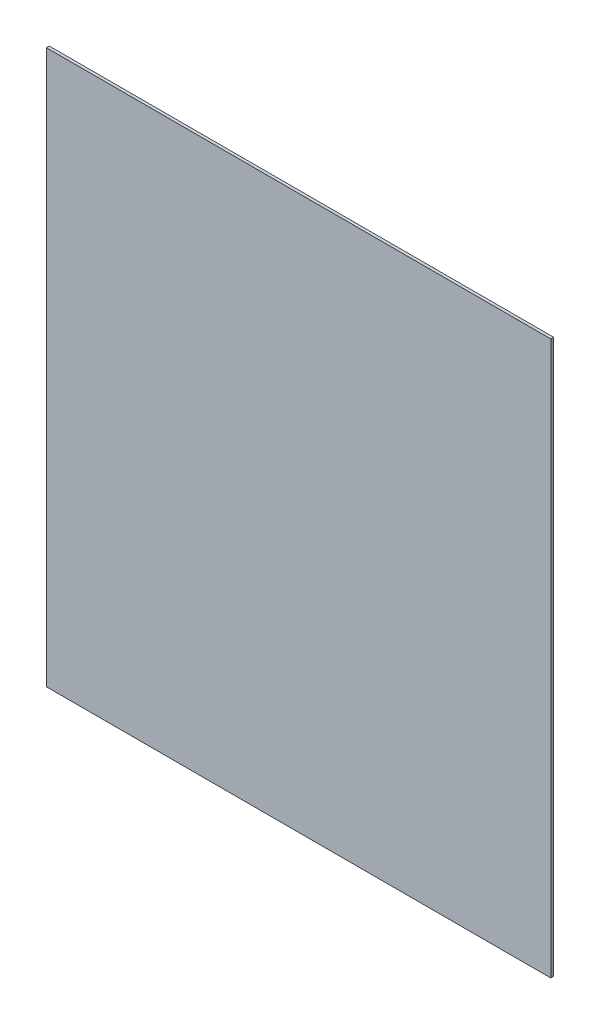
from build123d import *

# Parameters (mm, degrees)
BOSS_EXTRUDE1_DEPTH = 6.35


with BuildPart() as part:
    # 3DSketch1 → Boss-Extrude1 (new body)
    with BuildSketch(Plane(origin=(120.65, -2116.905368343, 0), x_dir=(-0.6736302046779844, 0.7390685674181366, 3.1580607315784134e-15), z_dir=(0, 0, 1))):
        Polygon((0, 0), (748.571564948, 821.289945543), (1649.643962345, 0), (901.072397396, -821.289945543), align=None)
    extrude(amount=BOSS_EXTRUDE1_DEPTH)


solid = part.part
